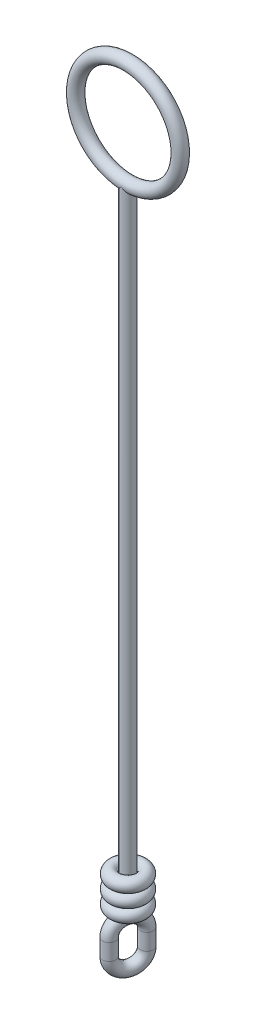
ISO-10303-21;
HEADER;
FILE_DESCRIPTION(('STEP AP214'),'2;1');
FILE_NAME('part.step','',(''),(''),'','','');
FILE_SCHEMA(('AUTOMOTIVE_DESIGN { 1 0 10303 214 1 1 1 1 }'));
ENDSEC;
DATA;
#1=APPLICATION_CONTEXT('core data for automotive mechanical design processes');
#2=APPLICATION_PROTOCOL_DEFINITION('international standard','automotive_design',2000,#1);
#3=PRODUCT_CONTEXT('',#1,'mechanical');
#4=PRODUCT('Part','Part','',(#3));
#5=PRODUCT_RELATED_PRODUCT_CATEGORY('part','',(#4));
#6=PRODUCT_DEFINITION_FORMATION('','',#4);
#7=PRODUCT_DEFINITION_CONTEXT('part definition',#1,'design');
#8=PRODUCT_DEFINITION('design','',#6,#7);
#9=PRODUCT_DEFINITION_SHAPE('','',#8);
#10=(LENGTH_UNIT() NAMED_UNIT(*) SI_UNIT(.MILLI.,.METRE.));
#11=(NAMED_UNIT(*) PLANE_ANGLE_UNIT() SI_UNIT($,.RADIAN.));
#12=(NAMED_UNIT(*) SI_UNIT($,.STERADIAN.) SOLID_ANGLE_UNIT());
#13=UNCERTAINTY_MEASURE_WITH_UNIT(LENGTH_MEASURE(1.E-05),#10,'distance_accuracy_value','');
#14=(GEOMETRIC_REPRESENTATION_CONTEXT(3) GLOBAL_UNCERTAINTY_ASSIGNED_CONTEXT((#13)) GLOBAL_UNIT_ASSIGNED_CONTEXT((#10,
#11,#12)) REPRESENTATION_CONTEXT('',''));
#15=CARTESIAN_POINT('',(0.,0.,0.));
#16=DIRECTION('',(0.,0.,1.));
#17=DIRECTION('',(1.,0.,0.));
#18=AXIS2_PLACEMENT_3D('',#15,#16,#17);
#19=CARTESIAN_POINT('',(0.,-39.8,0.));
#20=DIRECTION('',(0.,-1.,0.));
#21=DIRECTION('',(0.,0.,-1.));
#22=AXIS2_PLACEMENT_3D('',#19,#20,#21);
#23=TOROIDAL_SURFACE('',#22,0.8,0.399999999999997);
#24=CARTESIAN_POINT('',(0.,-39.8,-1.2));
#25=VERTEX_POINT('',#24);
#26=VERTEX_LOOP('',#25);
#27=FACE_BOUND('',#26,.T.);
#28=ADVANCED_FACE('F34',(#27),#23,.T.);
#29=CLOSED_SHELL('',(#28));
#30=MANIFOLD_SOLID_BREP('B2',#29);
#31=CARTESIAN_POINT('',(0.,-41.4,0.));
#32=DIRECTION('',(0.,-1.,0.));
#33=DIRECTION('',(0.,0.,-1.));
#34=AXIS2_PLACEMENT_3D('',#31,#32,#33);
#35=TOROIDAL_SURFACE('',#34,0.8,0.399999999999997);
#36=CARTESIAN_POINT('',(0.,-41.4,-1.2));
#37=VERTEX_POINT('',#36);
#38=VERTEX_LOOP('',#37);
#39=FACE_BOUND('',#38,.T.);
#40=ADVANCED_FACE('F53',(#39),#35,.T.);
#41=CLOSED_SHELL('',(#40));
#42=MANIFOLD_SOLID_BREP('B6',#41);
#43=CARTESIAN_POINT('',(0.,-40.6,0.));
#44=DIRECTION('',(0.,-1.,0.));
#45=DIRECTION('',(0.,0.,-1.));
#46=AXIS2_PLACEMENT_3D('',#43,#44,#45);
#47=TOROIDAL_SURFACE('',#46,0.8,0.399999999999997);
#48=CARTESIAN_POINT('',(0.,-40.6,-1.2));
#49=VERTEX_POINT('',#48);
#50=VERTEX_LOOP('',#49);
#51=FACE_BOUND('',#50,.T.);
#52=ADVANCED_FACE('F75',(#51),#47,.T.);
#53=CLOSED_SHELL('',(#52));
#54=MANIFOLD_SOLID_BREP('B30',#53);
#55=CARTESIAN_POINT('',(0.,-3.2,0.));
#56=DIRECTION('',(0.,-1.,0.));
#57=DIRECTION('',(1.,0.,0.));
#58=AXIS2_PLACEMENT_3D('',#55,#56,#57);
#59=CYLINDRICAL_SURFACE('',#58,0.4);
#60=CARTESIAN_POINT('',(0.375877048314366,-42.,0.136808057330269));
#61=CARTESIAN_POINT('',(0.375554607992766,-41.9990572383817,0.137693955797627));
#62=CARTESIAN_POINT('',(0.37522876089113,-41.9981151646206,0.138579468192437));
#63=CARTESIAN_POINT('',(0.36656577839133,-41.9733473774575,0.161866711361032));
#64=CARTESIAN_POINT('',(0.35604426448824,-41.9499698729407,0.184005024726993));
#65=CARTESIAN_POINT('',(0.330333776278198,-41.9044959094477,0.226951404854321));
#66=CARTESIAN_POINT('',(0.31513764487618,-41.8824014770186,0.24775737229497));
#67=CARTESIAN_POINT('',(0.282653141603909,-41.8433468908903,0.283903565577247));
#68=CARTESIAN_POINT('',(0.266068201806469,-41.8261253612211,0.299589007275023));
#69=CARTESIAN_POINT('',(0.229440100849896,-41.793373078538,0.328480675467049));
#70=CARTESIAN_POINT('',(0.209402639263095,-41.7778396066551,0.341690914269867));
#71=CARTESIAN_POINT('',(0.170107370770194,-41.7516561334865,0.362576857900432));
#72=CARTESIAN_POINT('',(0.151402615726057,-41.7406358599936,0.370825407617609));
#73=CARTESIAN_POINT('',(0.112081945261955,-41.7203692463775,0.384539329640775));
#74=CARTESIAN_POINT('',(0.0914662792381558,-41.7111226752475,0.390005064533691));
#75=CARTESIAN_POINT('',(0.0486112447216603,-41.6947111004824,0.397635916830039));
#76=CARTESIAN_POINT('',(0.0263595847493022,-41.6875644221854,0.399772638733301));
#77=CARTESIAN_POINT('',(-0.0188517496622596,-41.6758495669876,0.40019213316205));
#78=CARTESIAN_POINT('',(-0.0418106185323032,-41.6712785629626,0.39847914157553));
#79=CARTESIAN_POINT('',(-0.0841025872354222,-41.6654630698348,0.39155699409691));
#80=CARTESIAN_POINT('',(-0.103473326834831,-41.6638288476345,0.38689780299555));
#81=CARTESIAN_POINT('',(-0.141354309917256,-41.6627289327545,0.374718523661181));
#82=CARTESIAN_POINT('',(-0.159865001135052,-41.66326209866,0.36719994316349));
#83=CARTESIAN_POINT('',(-0.193959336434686,-41.6663348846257,0.350303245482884));
#84=CARTESIAN_POINT('',(-0.209658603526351,-41.668707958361,0.341125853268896));
#85=CARTESIAN_POINT('',(-0.239433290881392,-41.6751537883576,0.320928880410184));
#86=CARTESIAN_POINT('',(-0.253508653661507,-41.6792266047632,0.309909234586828));
#87=CARTESIAN_POINT('',(-0.280236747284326,-41.6890852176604,0.286007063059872));
#88=CARTESIAN_POINT('',(-0.292822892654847,-41.6949257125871,0.273073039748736));
#89=CARTESIAN_POINT('',(-0.315843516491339,-41.7080571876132,0.2460851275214));
#90=CARTESIAN_POINT('',(-0.326277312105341,-41.7153486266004,0.232030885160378));
#91=CARTESIAN_POINT('',(-0.346136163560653,-41.7321665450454,0.201402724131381));
#92=CARTESIAN_POINT('',(-0.355272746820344,-41.7418584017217,0.184733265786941));
#93=CARTESIAN_POINT('',(-0.370884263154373,-41.7625497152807,0.150968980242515));
#94=CARTESIAN_POINT('',(-0.377357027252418,-41.7735502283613,0.133873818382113));
#95=CARTESIAN_POINT('',(-0.390247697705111,-41.8020350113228,0.0916319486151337));
#96=CARTESIAN_POINT('',(-0.395221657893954,-41.8201439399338,0.0664621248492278));
#97=CARTESIAN_POINT('',(-0.400416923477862,-41.8580982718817,0.0169600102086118));
#98=CARTESIAN_POINT('',(-0.400631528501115,-41.8779460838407,-0.00737105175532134));
#99=CARTESIAN_POINT('',(-0.397386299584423,-41.9142364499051,-0.0491686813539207));
#100=CARTESIAN_POINT('',(-0.394754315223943,-41.9304216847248,-0.0669340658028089));
#101=CARTESIAN_POINT('',(-0.387338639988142,-41.9633854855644,-0.101382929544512));
#102=CARTESIAN_POINT('',(-0.38255860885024,-41.9801629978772,-0.118068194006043));
#103=CARTESIAN_POINT('',(-0.376519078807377,-41.9981151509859,-0.135034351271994));
#104=CARTESIAN_POINT('',(-0.376199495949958,-41.9990572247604,-0.135922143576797));
#105=CARTESIAN_POINT('',(-0.37587704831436,-42.,-0.13680805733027));
#106=B_SPLINE_CURVE_WITH_KNOTS('',3,(#60,#61,#62,#63,#64,#65,#66,#67,#68,#69,#70,#71,#72,#73,
#74,#75,#76,#77,#78,#79,#80,#81,#82,#83,#84,#85,#86,#87,#88,#89,#90,#91,#92,#93,#94,#95,#96,#97,
#98,#99,#100,#101,#102,#103,#104,#105),.UNSPECIFIED.,.F.,.F.,(4,2,2,2,2,2,2,2,2,2,2,2,2,2,2,2,2,
2,2,2,2,2,4),(0.,0.00400001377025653,0.105241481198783,0.206638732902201,0.29211099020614,
0.377443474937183,0.446842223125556,0.516231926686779,0.586210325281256,0.656111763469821,
0.71575494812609,0.77536672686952,0.830134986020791,0.884905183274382,0.941582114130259,
0.998276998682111,1.06204858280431,1.12587198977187,1.2195708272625,1.31340156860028,
1.3858065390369,1.45808861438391,1.46208862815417),.UNSPECIFIED.);
#107=CARTESIAN_POINT('',(0.375877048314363,-42.,0.136808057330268));
#108=VERTEX_POINT('',#107);
#109=CARTESIAN_POINT('',(-0.375877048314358,-42.,-0.136808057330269));
#110=VERTEX_POINT('',#109);
#111=EDGE_CURVE('E120',#108,#110,#106,.T.);
#112=ORIENTED_EDGE('',*,*,#111,.F.);
#113=CARTESIAN_POINT('',(-0.37587704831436,-42.,-0.13680805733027));
#114=CARTESIAN_POINT('',(-0.375554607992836,-41.9990572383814,-0.137693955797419));
#115=CARTESIAN_POINT('',(-0.375228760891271,-41.9981151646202,-0.138579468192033));
#116=CARTESIAN_POINT('',(-0.366565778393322,-41.9733473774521,-0.161866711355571));
#117=CARTESIAN_POINT('',(-0.356044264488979,-41.9499698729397,-0.184005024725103));
#118=CARTESIAN_POINT('',(-0.330333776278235,-41.90449590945,-0.226951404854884));
#119=CARTESIAN_POINT('',(-0.315137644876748,-41.8824014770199,-0.247757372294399));
#120=CARTESIAN_POINT('',(-0.282653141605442,-41.8433468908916,-0.283903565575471));
#121=CARTESIAN_POINT('',(-0.266068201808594,-41.8261253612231,-0.299589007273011));
#122=CARTESIAN_POINT('',(-0.229440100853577,-41.7933730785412,-0.328480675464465));
#123=CARTESIAN_POINT('',(-0.209402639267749,-41.7778396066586,-0.341690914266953));
#124=CARTESIAN_POINT('',(-0.170107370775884,-41.75165613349,-0.362576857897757));
#125=CARTESIAN_POINT('',(-0.151402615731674,-41.7406358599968,-0.370825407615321));
#126=CARTESIAN_POINT('',(-0.112081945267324,-41.72036924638,-0.384539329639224));
#127=CARTESIAN_POINT('',(-0.091466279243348,-41.7111226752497,-0.390005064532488));
#128=CARTESIAN_POINT('',(-0.0486112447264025,-41.694711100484,-0.397635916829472));
#129=CARTESIAN_POINT('',(-0.0263595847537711,-41.6875644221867,-0.399772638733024));
#130=CARTESIAN_POINT('',(0.018851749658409,-41.6758495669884,-0.40019213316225));
#131=CARTESIAN_POINT('',(0.0418106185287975,-41.6712785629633,-0.398479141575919));
#132=CARTESIAN_POINT('',(0.0841025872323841,-41.6654630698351,-0.391556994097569));
#133=CARTESIAN_POINT('',(0.103473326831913,-41.6638288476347,-0.386897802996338));
#134=CARTESIAN_POINT('',(0.141354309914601,-41.6627289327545,-0.374718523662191));
#135=CARTESIAN_POINT('',(0.159865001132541,-41.6632620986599,-0.367199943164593));
#136=CARTESIAN_POINT('',(0.193959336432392,-41.6663348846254,-0.35030324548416));
#137=CARTESIAN_POINT('',(0.209658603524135,-41.6687079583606,-0.341125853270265));
#138=CARTESIAN_POINT('',(0.239433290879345,-41.6751537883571,-0.320928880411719));
#139=CARTESIAN_POINT('',(0.253508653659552,-41.6792266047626,-0.309909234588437));
#140=CARTESIAN_POINT('',(0.280236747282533,-41.6890852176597,-0.286007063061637));
#141=CARTESIAN_POINT('',(0.29282289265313,-41.6949257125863,-0.273073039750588));
#142=CARTESIAN_POINT('',(0.315843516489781,-41.7080571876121,-0.246085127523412));
#143=CARTESIAN_POINT('',(0.326277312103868,-41.7153486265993,-0.232030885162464));
#144=CARTESIAN_POINT('',(0.346136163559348,-41.7321665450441,-0.201402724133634));
#145=CARTESIAN_POINT('',(0.355272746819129,-41.7418584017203,-0.184733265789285));
#146=CARTESIAN_POINT('',(0.370884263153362,-41.7625497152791,-0.150968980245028));
#147=CARTESIAN_POINT('',(0.377357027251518,-41.7735502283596,-0.133873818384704));
#148=CARTESIAN_POINT('',(0.390247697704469,-41.8020350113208,-0.0916319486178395));
#149=CARTESIAN_POINT('',(0.395221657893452,-41.8201439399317,-0.0664621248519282));
#150=CARTESIAN_POINT('',(0.400416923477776,-41.8580982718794,-0.016960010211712));
#151=CARTESIAN_POINT('',(0.400631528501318,-41.8779460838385,0.00737105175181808));
#152=CARTESIAN_POINT('',(0.397386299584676,-41.9142364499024,0.0491686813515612));
#153=CARTESIAN_POINT('',(0.394754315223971,-41.9304216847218,0.0669340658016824));
#154=CARTESIAN_POINT('',(0.387338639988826,-41.9633854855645,0.10138292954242));
#155=CARTESIAN_POINT('',(0.382558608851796,-41.9801629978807,0.118068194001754));
#156=CARTESIAN_POINT('',(0.376519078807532,-41.9981151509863,0.135034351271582));
#157=CARTESIAN_POINT('',(0.376199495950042,-41.9990572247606,0.135922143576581));
#158=CARTESIAN_POINT('',(0.375877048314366,-42.,0.136808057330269));
#159=B_SPLINE_CURVE_WITH_KNOTS('',3,(#113,#114,#115,#116,#117,#118,#119,#120,#121,#122,#123,
#124,#125,#126,#127,#128,#129,#130,#131,#132,#133,#134,#135,#136,#137,#138,#139,#140,#141,#142,
#143,#144,#145,#146,#147,#148,#149,#150,#151,#152,#153,#154,#155,#156,#157,#158),.UNSPECIFIED.,
.F.,.F.,(4,2,2,2,2,2,2,2,2,2,2,2,2,2,2,2,2,2,2,2,2,2,4),(0.,0.0040000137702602,
0.105241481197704,0.206638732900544,0.292110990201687,0.377443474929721,0.446842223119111,
0.516231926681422,0.586210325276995,0.656111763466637,0.715754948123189,0.775366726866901,
0.830134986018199,0.884905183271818,0.941582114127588,0.998276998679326,1.06204858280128,
1.12587198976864,1.21957082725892,1.31340156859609,1.38580653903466,1.45808861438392,
1.46208862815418),.UNSPECIFIED.);
#160=EDGE_CURVE('E123',#110,#108,#159,.T.);
#161=ORIENTED_EDGE('',*,*,#160,.F.);
#162=EDGE_LOOP('',(#112,#161));
#163=FACE_BOUND('',#162,.T.);
#164=CARTESIAN_POINT('',(0.,-3.2,0.400000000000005));
#165=CARTESIAN_POINT('',(0.000942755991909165,-3.20094275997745,0.399999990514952));
#166=CARTESIAN_POINT('',(0.00188577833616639,-3.20188536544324,0.399996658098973));
#167=CARTESIAN_POINT('',(0.0324562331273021,-3.23242870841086,0.399780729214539));
#168=CARTESIAN_POINT('',(0.0623311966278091,-3.26186337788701,0.396286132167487));
#169=CARTESIAN_POINT('',(0.121684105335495,-3.31957991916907,0.38226275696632));
#170=CARTESIAN_POINT('',(0.151161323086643,-3.34785983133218,0.371722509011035));
#171=CARTESIAN_POINT('',(0.199608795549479,-3.39379611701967,0.347344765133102));
#172=CARTESIAN_POINT('',(0.219024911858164,-3.41204716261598,0.335514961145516));
#173=CARTESIAN_POINT('',(0.256413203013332,-3.44693292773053,0.307881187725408));
#174=CARTESIAN_POINT('',(0.274388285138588,-3.46357091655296,0.292085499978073));
#175=CARTESIAN_POINT('',(0.304279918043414,-3.49106527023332,0.260339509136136));
#176=CARTESIAN_POINT('',(0.316651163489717,-3.50238147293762,0.245218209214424));
#177=CARTESIAN_POINT('',(0.339489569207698,-3.52318621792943,0.212470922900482));
#178=CARTESIAN_POINT('',(0.349958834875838,-3.53267678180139,0.194847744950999));
#179=CARTESIAN_POINT('',(0.36672383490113,-3.5478274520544,0.160651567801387));
#180=CARTESIAN_POINT('',(0.37343078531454,-3.5538687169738,0.144450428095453));
#181=CARTESIAN_POINT('',(0.384766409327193,-3.56406104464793,0.110769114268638));
#182=CARTESIAN_POINT('',(0.38939628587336,-3.56821320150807,0.0932896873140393));
#183=CARTESIAN_POINT('',(0.396284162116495,-3.57438504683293,0.0573962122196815));
#184=CARTESIAN_POINT('',(0.398529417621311,-3.576393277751,0.0389776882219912));
#185=CARTESIAN_POINT('',(0.400425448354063,-3.57808939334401,0.00190167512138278));
#186=CARTESIAN_POINT('',(0.400076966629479,-3.57777794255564,-0.016755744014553));
#187=CARTESIAN_POINT('',(0.396964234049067,-3.57499267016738,-0.0520043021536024));
#188=CARTESIAN_POINT('',(0.394418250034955,-3.57271421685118,-0.0686312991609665));
#189=CARTESIAN_POINT('',(0.387366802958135,-3.56639277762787,-0.101110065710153));
#190=CARTESIAN_POINT('',(0.382861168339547,-3.56234963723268,-0.116961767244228));
#191=CARTESIAN_POINT('',(0.371919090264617,-3.55250716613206,-0.148193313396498));
#192=CARTESIAN_POINT('',(0.365411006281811,-3.54664258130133,-0.163527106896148));
#193=CARTESIAN_POINT('',(0.350859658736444,-3.5334890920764,-0.192782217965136));
#194=CARTESIAN_POINT('',(0.342815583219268,-3.52619943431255,-0.20670278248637));
#195=CARTESIAN_POINT('',(0.321449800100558,-3.50676649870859,-0.239173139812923));
#196=CARTESIAN_POINT('',(0.307416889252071,-3.49394561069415,-0.256852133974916));
#197=CARTESIAN_POINT('',(0.27751076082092,-3.46644761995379,-0.288913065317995));
#198=CARTESIAN_POINT('',(0.261633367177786,-3.45176629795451,-0.303287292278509));
#199=CARTESIAN_POINT('',(0.223023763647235,-3.41581245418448,-0.333233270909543));
#200=CARTESIAN_POINT('',(0.199805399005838,-3.39400388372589,-0.347530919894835));
#201=CARTESIAN_POINT('',(0.15226022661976,-3.34887680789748,-0.370835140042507));
#202=CARTESIAN_POINT('',(0.127932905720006,-3.32555760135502,-0.379839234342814));
#203=CARTESIAN_POINT('',(0.0867126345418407,-3.28560864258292,-0.390870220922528));
#204=CARTESIAN_POINT('',(0.0699215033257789,-3.26921572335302,-0.394206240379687));
#205=CARTESIAN_POINT('',(0.0363392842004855,-3.23617727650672,-0.398705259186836));
#206=CARTESIAN_POINT('',(0.0195482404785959,-3.2195322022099,-0.399871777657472));
#207=CARTESIAN_POINT('',(0.00188580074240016,-3.20188538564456,-0.399996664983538));
#208=CARTESIAN_POINT('',(0.000942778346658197,-3.20094278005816,-0.399999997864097));
#209=CARTESIAN_POINT('',(0.,-3.2,-0.400000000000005));
#210=B_SPLINE_CURVE_WITH_KNOTS('',3,(#164,#165,#166,#167,#168,#169,#170,#171,#172,#173,#174,
#175,#176,#177,#178,#179,#180,#181,#182,#183,#184,#185,#186,#187,#188,#189,#190,#191,#192,#193,
#194,#195,#196,#197,#198,#199,#200,#201,#202,#203,#204,#205,#206,#207,#208,#209),.UNSPECIFIED.,
.F.,.F.,(4,2,2,2,2,2,2,2,2,2,2,2,2,2,2,2,2,2,2,2,2,2,4),(0.,0.00400001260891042,
0.129635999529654,0.255477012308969,0.342658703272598,0.429659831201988,0.497151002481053,
0.564567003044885,0.61997755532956,0.675355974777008,0.731028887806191,0.786685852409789,
0.837378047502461,0.888074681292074,0.94085154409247,0.993656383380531,1.07110042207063,
1.14872334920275,1.25291478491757,1.35715493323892,1.42817071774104,1.49907120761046,
1.50307122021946),.UNSPECIFIED.);
#211=CARTESIAN_POINT('',(0.,-3.2,0.4));
#212=VERTEX_POINT('',#211);
#213=CARTESIAN_POINT('',(7.11994768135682E-13,-3.2,-0.4));
#214=VERTEX_POINT('',#213);
#215=EDGE_CURVE('E73',#212,#214,#210,.T.);
#216=ORIENTED_EDGE('',*,*,#215,.F.);
#217=CARTESIAN_POINT('',(0.,-3.2,-0.400000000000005));
#218=CARTESIAN_POINT('',(-0.000942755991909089,-3.20094275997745,-0.399999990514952));
#219=CARTESIAN_POINT('',(-0.00188577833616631,-3.20188536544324,-0.399996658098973));
#220=CARTESIAN_POINT('',(-0.032456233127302,-3.23242870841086,-0.399780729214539));
#221=CARTESIAN_POINT('',(-0.0623311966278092,-3.26186337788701,-0.396286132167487));
#222=CARTESIAN_POINT('',(-0.121684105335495,-3.31957991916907,-0.38226275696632));
#223=CARTESIAN_POINT('',(-0.151161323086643,-3.34785983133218,-0.371722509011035));
#224=CARTESIAN_POINT('',(-0.199608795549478,-3.39379611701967,-0.347344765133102));
#225=CARTESIAN_POINT('',(-0.219024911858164,-3.41204716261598,-0.335514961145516));
#226=CARTESIAN_POINT('',(-0.256413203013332,-3.44693292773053,-0.307881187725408));
#227=CARTESIAN_POINT('',(-0.274388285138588,-3.46357091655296,-0.292085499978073));
#228=CARTESIAN_POINT('',(-0.304279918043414,-3.49106527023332,-0.260339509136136));
#229=CARTESIAN_POINT('',(-0.316651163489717,-3.50238147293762,-0.245218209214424));
#230=CARTESIAN_POINT('',(-0.339489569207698,-3.52318621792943,-0.212470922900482));
#231=CARTESIAN_POINT('',(-0.349958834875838,-3.53267678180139,-0.194847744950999));
#232=CARTESIAN_POINT('',(-0.366723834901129,-3.5478274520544,-0.160651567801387));
#233=CARTESIAN_POINT('',(-0.373430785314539,-3.5538687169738,-0.144450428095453));
#234=CARTESIAN_POINT('',(-0.384766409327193,-3.56406104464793,-0.110769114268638));
#235=CARTESIAN_POINT('',(-0.38939628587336,-3.56821320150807,-0.093289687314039));
#236=CARTESIAN_POINT('',(-0.396284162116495,-3.57438504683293,-0.0573962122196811));
#237=CARTESIAN_POINT('',(-0.398529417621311,-3.576393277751,-0.0389776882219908));
#238=CARTESIAN_POINT('',(-0.400425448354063,-3.57808939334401,-0.00190167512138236));
#239=CARTESIAN_POINT('',(-0.400076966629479,-3.57777794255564,0.0167557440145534));
#240=CARTESIAN_POINT('',(-0.396964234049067,-3.57499267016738,0.0520043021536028));
#241=CARTESIAN_POINT('',(-0.394418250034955,-3.57271421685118,0.0686312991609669));
#242=CARTESIAN_POINT('',(-0.387366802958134,-3.56639277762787,0.101110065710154));
#243=CARTESIAN_POINT('',(-0.382861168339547,-3.56234963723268,0.116961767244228));
#244=CARTESIAN_POINT('',(-0.371919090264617,-3.55250716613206,0.148193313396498));
#245=CARTESIAN_POINT('',(-0.36541100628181,-3.54664258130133,0.163527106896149));
#246=CARTESIAN_POINT('',(-0.350859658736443,-3.5334890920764,0.192782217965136));
#247=CARTESIAN_POINT('',(-0.342815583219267,-3.52619943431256,0.20670278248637));
#248=CARTESIAN_POINT('',(-0.321449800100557,-3.50676649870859,0.239173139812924));
#249=CARTESIAN_POINT('',(-0.30741688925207,-3.49394561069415,0.256852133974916));
#250=CARTESIAN_POINT('',(-0.27751076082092,-3.46644761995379,0.288913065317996));
#251=CARTESIAN_POINT('',(-0.261633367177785,-3.45176629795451,0.303287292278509));
#252=CARTESIAN_POINT('',(-0.223023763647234,-3.41581245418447,0.333233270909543));
#253=CARTESIAN_POINT('',(-0.199805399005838,-3.39400388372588,0.347530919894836));
#254=CARTESIAN_POINT('',(-0.152260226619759,-3.34887680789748,0.370835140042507));
#255=CARTESIAN_POINT('',(-0.127932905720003,-3.32555760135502,0.379839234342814));
#256=CARTESIAN_POINT('',(-0.086712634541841,-3.28560864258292,0.390870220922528));
#257=CARTESIAN_POINT('',(-0.0699215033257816,-3.26921572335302,0.394206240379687));
#258=CARTESIAN_POINT('',(-0.0363392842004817,-3.23617727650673,0.398705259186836));
#259=CARTESIAN_POINT('',(-0.019548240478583,-3.21953220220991,0.399871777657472));
#260=CARTESIAN_POINT('',(-0.00188580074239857,-3.20188538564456,0.399996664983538));
#261=CARTESIAN_POINT('',(-0.000942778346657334,-3.20094278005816,0.399999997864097));
#262=CARTESIAN_POINT('',(0.,-3.2,0.400000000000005));
#263=B_SPLINE_CURVE_WITH_KNOTS('',3,(#217,#218,#219,#220,#221,#222,#223,#224,#225,#226,#227,
#228,#229,#230,#231,#232,#233,#234,#235,#236,#237,#238,#239,#240,#241,#242,#243,#244,#245,#246,
#247,#248,#249,#250,#251,#252,#253,#254,#255,#256,#257,#258,#259,#260,#261,#262),.UNSPECIFIED.,
.F.,.F.,(4,2,2,2,2,2,2,2,2,2,2,2,2,2,2,2,2,2,2,2,2,2,4),(0.,0.00400001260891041,
0.129635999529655,0.255477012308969,0.342658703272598,0.429659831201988,0.497151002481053,
0.564567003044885,0.61997755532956,0.675355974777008,0.731028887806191,0.786685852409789,
0.837378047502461,0.888074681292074,0.940851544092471,0.993656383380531,1.07110042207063,
1.14872334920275,1.25291478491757,1.35715493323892,1.42817071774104,1.49907120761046,
1.50307122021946),.UNSPECIFIED.);
#264=EDGE_CURVE('E100',#214,#212,#263,.T.);
#265=ORIENTED_EDGE('',*,*,#264,.F.);
#266=EDGE_LOOP('',(#216,#265));
#267=FACE_BOUND('',#266,.T.);
#268=ADVANCED_FACE('F88',(#163,#267),#59,.T.);
#269=CARTESIAN_POINT('',(0.,0.,0.));
#270=DIRECTION('',(0.,0.,-1.));
#271=DIRECTION('',(-1.,0.,0.));
#272=AXIS2_PLACEMENT_3D('',#269,#270,#271);
#273=TOROIDAL_SURFACE('',#272,3.2,0.4);
#274=ORIENTED_EDGE('',*,*,#264,.T.);
#275=ORIENTED_EDGE('',*,*,#215,.T.);
#276=EDGE_LOOP('',(#274,#275));
#277=FACE_BOUND('',#276,.T.);
#278=ADVANCED_FACE('F90',(#277),#273,.T.);
#279=CARTESIAN_POINT('',(0.,-42.9,0.));
#280=DIRECTION('',(-0.939692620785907,0.,-0.342020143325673));
#281=DIRECTION('',(-0.342020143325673,0.,0.939692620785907));
#282=AXIS2_PLACEMENT_3D('',#279,#280,#281);
#283=TOROIDAL_SURFACE('',#282,0.899999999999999,0.4);
#284=CARTESIAN_POINT('',(-0.209235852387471,-41.7529411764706,0.574870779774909));
#285=VERTEX_POINT('',#284);
#286=VERTEX_LOOP('',#285);
#287=FACE_BOUND('',#286,.T.);
#288=CARTESIAN_POINT('',(0.209235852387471,-41.7529411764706,-0.57487077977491));
#289=VERTEX_POINT('',#288);
#290=VERTEX_LOOP('',#289);
#291=FACE_BOUND('',#290,.T.);
#292=CARTESIAN_POINT('',(0.307818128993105,-42.9,-0.445723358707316));
#293=CARTESIAN_POINT('',(0.314363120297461,-42.9,-0.445723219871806));
#294=CARTESIAN_POINT('',(0.320908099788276,-42.9,-0.445883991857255));
#295=CARTESIAN_POINT('',(0.333982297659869,-42.9,-0.446526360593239));
#296=CARTESIAN_POINT('',(0.340511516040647,-42.9,-0.447007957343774));
#297=CARTESIAN_POINT('',(0.353538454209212,-42.9,-0.4482909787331));
#298=CARTESIAN_POINT('',(0.360036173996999,-42.9,-0.44909240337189));
#299=CARTESIAN_POINT('',(0.372984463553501,-42.9,-0.451013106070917));
#300=CARTESIAN_POINT('',(0.379435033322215,-42.9,-0.452132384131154));
#301=CARTESIAN_POINT('',(0.392273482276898,-42.9,-0.454686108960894));
#302=CARTESIAN_POINT('',(0.398661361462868,-42.9,-0.456120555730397));
#303=CARTESIAN_POINT('',(0.411359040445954,-42.9,-0.459301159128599));
#304=CARTESIAN_POINT('',(0.417668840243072,-42.9,-0.461047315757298));
#305=CARTESIAN_POINT('',(0.430195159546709,-42.9,-0.464847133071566));
#306=CARTESIAN_POINT('',(0.436411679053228,-42.9,-0.466900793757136));
#307=CARTESIAN_POINT('',(0.448736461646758,-42.9,-0.471310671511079));
#308=CARTESIAN_POINT('',(0.454844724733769,-42.9,-0.473666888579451));
#309=CARTESIAN_POINT('',(0.466938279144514,-42.9,-0.478676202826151));
#310=CARTESIAN_POINT('',(0.472923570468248,-42.9,-0.481329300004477));
#311=CARTESIAN_POINT('',(0.484756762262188,-42.9,-0.4869259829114));
#312=CARTESIAN_POINT('',(0.490604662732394,-42.9,-0.489869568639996));
#313=CARTESIAN_POINT('',(0.502148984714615,-42.9,-0.496040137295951));
#314=CARTESIAN_POINT('',(0.50784540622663,-42.9,-0.49926712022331));
#315=CARTESIAN_POINT('',(0.519073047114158,-42.9,-0.505996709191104));
#316=CARTESIAN_POINT('',(0.52460426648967,-42.9,-0.50949931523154));
#317=CARTESIAN_POINT('',(0.535488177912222,-42.9,-0.516771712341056));
#318=CARTESIAN_POINT('',(0.540840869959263,-42.9,-0.520541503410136));
#319=CARTESIAN_POINT('',(0.551354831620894,-42.9,-0.528339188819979));
#320=CARTESIAN_POINT('',(0.556516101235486,-42.9,-0.532367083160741));
#321=CARTESIAN_POINT('',(0.566634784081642,-42.9,-0.540671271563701));
#322=CARTESIAN_POINT('',(0.571592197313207,-42.9,-0.544947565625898));
#323=CARTESIAN_POINT('',(0.581291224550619,-42.9,-0.553738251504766));
#324=CARTESIAN_POINT('',(0.586032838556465,-42.9,-0.558252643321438));
#325=CARTESIAN_POINT('',(0.595288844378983,-42.9,-0.567508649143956));
#326=CARTESIAN_POINT('',(0.599803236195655,-42.9,-0.572250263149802));
#327=CARTESIAN_POINT('',(0.608593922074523,-42.9,-0.581949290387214));
#328=CARTESIAN_POINT('',(0.612870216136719,-42.9,-0.58690670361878));
#329=CARTESIAN_POINT('',(0.621174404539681,-42.9,-0.597025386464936));
#330=CARTESIAN_POINT('',(0.625202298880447,-42.9,-0.602186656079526));
#331=CARTESIAN_POINT('',(0.63299998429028,-42.9,-0.612700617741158));
#332=CARTESIAN_POINT('',(0.636769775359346,-42.9,-0.6180533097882));
#333=CARTESIAN_POINT('',(0.644042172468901,-42.9,-0.62893722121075));
#334=CARTESIAN_POINT('',(0.647544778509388,-42.9,-0.63446844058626));
#335=CARTESIAN_POINT('',(0.65427436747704,-42.9,-0.645696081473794));
#336=CARTESIAN_POINT('',(0.657501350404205,-42.9,-0.651392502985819));
#337=CARTESIAN_POINT('',(0.66367191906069,-42.9,-0.662936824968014));
#338=CARTESIAN_POINT('',(0.66661550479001,-42.9,-0.668784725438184));
#339=CARTESIAN_POINT('',(0.672212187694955,-42.9,-0.680617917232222));
#340=CARTESIAN_POINT('',(0.674865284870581,-42.9,-0.686603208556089));
#341=CARTESIAN_POINT('',(0.679874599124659,-42.9,-0.698696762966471));
#342=CARTESIAN_POINT('',(0.68223081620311,-42.9,-0.704805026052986));
#343=CARTESIAN_POINT('',(0.686640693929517,-42.9,-0.717129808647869));
#344=CARTESIAN_POINT('',(0.688694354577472,-42.9,-0.723346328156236));
#345=CARTESIAN_POINT('',(0.692494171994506,-42.9,-0.735872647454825));
#346=CARTESIAN_POINT('',(0.694240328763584,-42.9,-0.742182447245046));
#347=CARTESIAN_POINT('',(0.697420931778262,-42.9,-0.754880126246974));
#348=CARTESIAN_POINT('',(0.698855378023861,-42.9,-0.761268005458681));
#349=CARTESIAN_POINT('',(0.701409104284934,-42.9,-0.774106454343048));
#350=CARTESIAN_POINT('',(0.702528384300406,-42.9,-0.780557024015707));
#351=CARTESIAN_POINT('',(0.704449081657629,-42.9,-0.793505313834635));
#352=CARTESIAN_POINT('',(0.70525049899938,-42.9,-0.800003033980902));
#353=CARTESIAN_POINT('',(0.706533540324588,-42.9,-0.813029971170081));
#354=CARTESIAN_POINT('',(0.707015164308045,-42.9,-0.819559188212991));
#355=CARTESIAN_POINT('',(0.707657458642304,-42.9,-0.832633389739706));
#356=CARTESIAN_POINT('',(0.707818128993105,-42.9,-0.839178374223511));
#357=CARTESIAN_POINT('',(0.707818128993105,-42.9,-0.852268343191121));
#358=CARTESIAN_POINT('',(0.707657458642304,-42.9,-0.858813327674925));
#359=CARTESIAN_POINT('',(0.707015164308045,-42.9,-0.87188752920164));
#360=CARTESIAN_POINT('',(0.706533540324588,-42.9,-0.878416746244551));
#361=CARTESIAN_POINT('',(0.70525049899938,-42.9,-0.891443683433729));
#362=CARTESIAN_POINT('',(0.704449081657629,-42.9,-0.897941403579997));
#363=CARTESIAN_POINT('',(0.702528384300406,-42.9,-0.910889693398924));
#364=CARTESIAN_POINT('',(0.701409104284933,-42.9,-0.917340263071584));
#365=CARTESIAN_POINT('',(0.698855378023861,-42.9,-0.93017871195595));
#366=CARTESIAN_POINT('',(0.697420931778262,-42.9,-0.936566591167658));
#367=CARTESIAN_POINT('',(0.694240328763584,-42.9,-0.949264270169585));
#368=CARTESIAN_POINT('',(0.692494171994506,-42.9,-0.955574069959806));
#369=CARTESIAN_POINT('',(0.688694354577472,-42.9,-0.968100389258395));
#370=CARTESIAN_POINT('',(0.686640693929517,-42.9,-0.974316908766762));
#371=CARTESIAN_POINT('',(0.68223081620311,-42.9,-0.986641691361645));
#372=CARTESIAN_POINT('',(0.679874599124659,-42.9,-0.99274995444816));
#373=CARTESIAN_POINT('',(0.674865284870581,-42.9,-1.00484350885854));
#374=CARTESIAN_POINT('',(0.672212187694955,-42.9,-1.01082880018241));
#375=CARTESIAN_POINT('',(0.66661550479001,-42.9,-1.02266199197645));
#376=CARTESIAN_POINT('',(0.66367191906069,-42.9,-1.02850989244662));
#377=CARTESIAN_POINT('',(0.657501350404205,-42.9,-1.04005421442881));
#378=CARTESIAN_POINT('',(0.65427436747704,-42.9,-1.04575063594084));
#379=CARTESIAN_POINT('',(0.647544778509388,-42.9,-1.05697827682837));
#380=CARTESIAN_POINT('',(0.644042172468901,-42.9,-1.06250949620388));
#381=CARTESIAN_POINT('',(0.636769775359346,-42.9,-1.07339340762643));
#382=CARTESIAN_POINT('',(0.63299998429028,-42.9,-1.07874609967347));
#383=CARTESIAN_POINT('',(0.625202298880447,-42.9,-1.08926006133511));
#384=CARTESIAN_POINT('',(0.621174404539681,-42.9,-1.0944213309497));
#385=CARTESIAN_POINT('',(0.612870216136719,-42.9,-1.10454001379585));
#386=CARTESIAN_POINT('',(0.608593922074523,-42.9,-1.10949742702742));
#387=CARTESIAN_POINT('',(0.599803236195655,-42.9,-1.11919645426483));
#388=CARTESIAN_POINT('',(0.595288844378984,-42.9,-1.12393806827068));
#389=CARTESIAN_POINT('',(0.586032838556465,-42.9,-1.13319407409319));
#390=CARTESIAN_POINT('',(0.581291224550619,-42.9,-1.13770846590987));
#391=CARTESIAN_POINT('',(0.571592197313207,-42.9,-1.14649915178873));
#392=CARTESIAN_POINT('',(0.566634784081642,-42.9,-1.15077544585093));
#393=CARTESIAN_POINT('',(0.556516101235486,-42.9,-1.15907963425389));
#394=CARTESIAN_POINT('',(0.551354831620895,-42.9,-1.16310752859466));
#395=CARTESIAN_POINT('',(0.540840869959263,-42.9,-1.17090521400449));
#396=CARTESIAN_POINT('',(0.535488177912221,-42.9,-1.17467500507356));
#397=CARTESIAN_POINT('',(0.524604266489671,-42.9,-1.18194740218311));
#398=CARTESIAN_POINT('',(0.519073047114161,-42.9,-1.1854500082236));
#399=CARTESIAN_POINT('',(0.507845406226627,-42.9,-1.19217959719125));
#400=CARTESIAN_POINT('',(0.502148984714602,-42.9,-1.19540658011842));
#401=CARTESIAN_POINT('',(0.490604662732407,-42.9,-1.2015771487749));
#402=CARTESIAN_POINT('',(0.484756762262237,-42.9,-1.20452073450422));
#403=CARTESIAN_POINT('',(0.472923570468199,-42.9,-1.21011741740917));
#404=CARTESIAN_POINT('',(0.466938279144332,-42.9,-1.21277051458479));
#405=CARTESIAN_POINT('',(0.45484472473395,-42.9,-1.21777982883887));
#406=CARTESIAN_POINT('',(0.448736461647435,-42.9,-1.22013604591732));
#407=CARTESIAN_POINT('',(0.436411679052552,-42.9,-1.22454592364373));
#408=CARTESIAN_POINT('',(0.430195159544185,-42.9,-1.22659958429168));
#409=CARTESIAN_POINT('',(0.417668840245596,-42.9,-1.23039940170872));
#410=CARTESIAN_POINT('',(0.411359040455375,-42.9,-1.23214555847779));
#411=CARTESIAN_POINT('',(0.398661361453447,-42.9,-1.23532616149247));
#412=CARTESIAN_POINT('',(0.39227348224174,-42.9,-1.23676060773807));
#413=CARTESIAN_POINT('',(0.379435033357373,-42.9,-1.23931433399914));
#414=CARTESIAN_POINT('',(0.372984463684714,-42.9,-1.24043361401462));
#415=CARTESIAN_POINT('',(0.360036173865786,-42.9,-1.24235431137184));
#416=CARTESIAN_POINT('',(0.353538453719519,-42.9,-1.24315572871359));
#417=CARTESIAN_POINT('',(0.340511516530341,-42.9,-1.2444387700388));
#418=CARTESIAN_POINT('',(0.33398229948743,-42.9,-1.24492039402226));
#419=CARTESIAN_POINT('',(0.320908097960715,-42.9,-1.24556268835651));
#420=CARTESIAN_POINT('',(0.31436311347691,-42.9,-1.24572335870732));
#421=CARTESIAN_POINT('',(0.301273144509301,-42.9,-1.24572335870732));
#422=CARTESIAN_POINT('',(0.294728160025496,-42.9,-1.24556268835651));
#423=CARTESIAN_POINT('',(0.28165395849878,-42.9,-1.24492039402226));
#424=CARTESIAN_POINT('',(0.27512474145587,-42.9,-1.2444387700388));
#425=CARTESIAN_POINT('',(0.262097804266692,-42.9,-1.24315572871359));
#426=CARTESIAN_POINT('',(0.255600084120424,-42.9,-1.24235431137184));
#427=CARTESIAN_POINT('',(0.242651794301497,-42.9,-1.24043361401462));
#428=CARTESIAN_POINT('',(0.236201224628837,-42.9,-1.23931433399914));
#429=CARTESIAN_POINT('',(0.223362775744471,-42.9,-1.23676060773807));
#430=CARTESIAN_POINT('',(0.216974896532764,-42.9,-1.23532616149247));
#431=CARTESIAN_POINT('',(0.204277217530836,-42.9,-1.23214555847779));
#432=CARTESIAN_POINT('',(0.197967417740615,-42.9,-1.23039940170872));
#433=CARTESIAN_POINT('',(0.185441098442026,-42.9,-1.22659958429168));
#434=CARTESIAN_POINT('',(0.179224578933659,-42.9,-1.22454592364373));
#435=CARTESIAN_POINT('',(0.166899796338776,-42.9,-1.22013604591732));
#436=CARTESIAN_POINT('',(0.160791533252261,-42.9,-1.21777982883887));
#437=CARTESIAN_POINT('',(0.148697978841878,-42.9,-1.21277051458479));
#438=CARTESIAN_POINT('',(0.142712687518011,-42.9,-1.21011741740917));
#439=CARTESIAN_POINT('',(0.130879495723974,-42.9,-1.20452073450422));
#440=CARTESIAN_POINT('',(0.125031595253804,-42.9,-1.2015771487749));
#441=CARTESIAN_POINT('',(0.113487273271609,-42.9,-1.19540658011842));
#442=CARTESIAN_POINT('',(0.107790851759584,-42.9,-1.19217959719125));
#443=CARTESIAN_POINT('',(0.0965632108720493,-42.9,-1.1854500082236));
#444=CARTESIAN_POINT('',(0.0910319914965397,-42.9,-1.18194740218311));
#445=CARTESIAN_POINT('',(0.080148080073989,-42.9,-1.17467500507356));
#446=CARTESIAN_POINT('',(0.0747953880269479,-42.9,-1.17090521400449));
#447=CARTESIAN_POINT('',(0.064281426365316,-42.9,-1.16310752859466));
#448=CARTESIAN_POINT('',(0.0591201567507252,-42.9,-1.15907963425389));
#449=CARTESIAN_POINT('',(0.049001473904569,-42.9,-1.15077544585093));
#450=CARTESIAN_POINT('',(0.0440440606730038,-42.9,-1.14649915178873));
#451=CARTESIAN_POINT('',(0.0343450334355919,-42.9,-1.13770846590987));
#452=CARTESIAN_POINT('',(0.0296034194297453,-42.9,-1.13319407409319));
#453=CARTESIAN_POINT('',(0.0203474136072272,-42.9,-1.12393806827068));
#454=CARTESIAN_POINT('',(0.0158330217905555,-42.9,-1.11919645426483));
#455=CARTESIAN_POINT('',(0.00704233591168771,-42.9,-1.10949742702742));
#456=CARTESIAN_POINT('',(0.00276604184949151,-42.9,-1.10454001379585));
#457=CARTESIAN_POINT('',(-0.00553814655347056,-42.9,-1.0944213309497));
#458=CARTESIAN_POINT('',(-0.00956604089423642,-42.9,-1.08926006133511));
#459=CARTESIAN_POINT('',(-0.0173637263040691,-42.9,-1.07874609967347));
#460=CARTESIAN_POINT('',(-0.0211335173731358,-42.9,-1.07339340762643));
#461=CARTESIAN_POINT('',(-0.02840591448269,-42.9,-1.06250949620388));
#462=CARTESIAN_POINT('',(-0.0319085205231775,-42.9,-1.05697827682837));
#463=CARTESIAN_POINT('',(-0.0386381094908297,-42.9,-1.04575063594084));
#464=CARTESIAN_POINT('',(-0.0418650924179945,-42.9,-1.04005421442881));
#465=CARTESIAN_POINT('',(-0.0480356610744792,-42.9,-1.02850989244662));
#466=CARTESIAN_POINT('',(-0.0509792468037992,-42.9,-1.02266199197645));
#467=CARTESIAN_POINT('',(-0.056575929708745,-42.9,-1.01082880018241));
#468=CARTESIAN_POINT('',(-0.0592290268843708,-42.9,-1.00484350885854));
#469=CARTESIAN_POINT('',(-0.0642383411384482,-42.9,-0.992749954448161));
#470=CARTESIAN_POINT('',(-0.0665945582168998,-42.9,-0.986641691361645));
#471=CARTESIAN_POINT('',(-0.0710044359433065,-42.9,-0.974316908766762));
#472=CARTESIAN_POINT('',(-0.0730580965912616,-42.9,-0.968100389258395));
#473=CARTESIAN_POINT('',(-0.0768579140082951,-42.9,-0.955574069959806));
#474=CARTESIAN_POINT('',(-0.0786040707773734,-42.9,-0.949264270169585));
#475=CARTESIAN_POINT('',(-0.0817846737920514,-42.9,-0.936566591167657));
#476=CARTESIAN_POINT('',(-0.0832191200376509,-42.9,-0.93017871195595));
#477=CARTESIAN_POINT('',(-0.085772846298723,-42.9,-0.917340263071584));
#478=CARTESIAN_POINT('',(-0.0868921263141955,-42.9,-0.910889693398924));
#479=CARTESIAN_POINT('',(-0.0888128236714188,-42.9,-0.897941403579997));
#480=CARTESIAN_POINT('',(-0.0896142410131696,-42.9,-0.891443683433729));
#481=CARTESIAN_POINT('',(-0.0908972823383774,-42.9,-0.878416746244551));
#482=CARTESIAN_POINT('',(-0.0913789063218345,-42.9,-0.87188752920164));
#483=CARTESIAN_POINT('',(-0.0920212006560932,-42.9,-0.858813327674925));
#484=CARTESIAN_POINT('',(-0.0921818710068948,-42.9,-0.852268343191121));
#485=CARTESIAN_POINT('',(-0.0921818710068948,-42.9,-0.839178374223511));
#486=CARTESIAN_POINT('',(-0.0920212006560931,-42.9,-0.832633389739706));
#487=CARTESIAN_POINT('',(-0.0913789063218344,-42.9,-0.819559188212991));
#488=CARTESIAN_POINT('',(-0.0908972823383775,-42.9,-0.813029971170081));
#489=CARTESIAN_POINT('',(-0.0896142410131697,-42.9,-0.800003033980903));
#490=CARTESIAN_POINT('',(-0.0888128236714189,-42.9,-0.793505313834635));
#491=CARTESIAN_POINT('',(-0.0868921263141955,-42.9,-0.780557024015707));
#492=CARTESIAN_POINT('',(-0.085772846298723,-42.9,-0.774106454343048));
#493=CARTESIAN_POINT('',(-0.0832191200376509,-42.9,-0.761268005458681));
#494=CARTESIAN_POINT('',(-0.0817846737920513,-42.9,-0.754880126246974));
#495=CARTESIAN_POINT('',(-0.0786040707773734,-42.9,-0.742182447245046));
#496=CARTESIAN_POINT('',(-0.0768579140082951,-42.9,-0.735872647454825));
#497=CARTESIAN_POINT('',(-0.0730580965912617,-42.9,-0.723346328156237));
#498=CARTESIAN_POINT('',(-0.0710044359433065,-42.9,-0.717129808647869));
#499=CARTESIAN_POINT('',(-0.0665945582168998,-42.9,-0.704805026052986));
#500=CARTESIAN_POINT('',(-0.0642383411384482,-42.9,-0.698696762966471));
#501=CARTESIAN_POINT('',(-0.0592290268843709,-42.9,-0.686603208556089));
#502=CARTESIAN_POINT('',(-0.0565759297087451,-42.9,-0.680617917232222));
#503=CARTESIAN_POINT('',(-0.0509792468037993,-42.9,-0.668784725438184));
#504=CARTESIAN_POINT('',(-0.0480356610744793,-42.9,-0.662936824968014));
#505=CARTESIAN_POINT('',(-0.0418650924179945,-42.9,-0.651392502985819));
#506=CARTESIAN_POINT('',(-0.0386381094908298,-42.9,-0.645696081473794));
#507=CARTESIAN_POINT('',(-0.0319085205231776,-42.9,-0.63446844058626));
#508=CARTESIAN_POINT('',(-0.0284059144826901,-42.9,-0.62893722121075));
#509=CARTESIAN_POINT('',(-0.0211335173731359,-42.9,-0.6180533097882));
#510=CARTESIAN_POINT('',(-0.0173637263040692,-42.9,-0.612700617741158));
#511=CARTESIAN_POINT('',(-0.00956604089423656,-42.9,-0.602186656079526));
#512=CARTESIAN_POINT('',(-0.00553814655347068,-42.9,-0.597025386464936));
#513=CARTESIAN_POINT('',(0.00276604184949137,-42.9,-0.58690670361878));
#514=CARTESIAN_POINT('',(0.00704233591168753,-42.9,-0.581949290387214));
#515=CARTESIAN_POINT('',(0.0158330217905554,-42.9,-0.572250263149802));
#516=CARTESIAN_POINT('',(0.020347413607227,-42.9,-0.567508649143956));
#517=CARTESIAN_POINT('',(0.0296034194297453,-42.9,-0.558252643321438));
#518=CARTESIAN_POINT('',(0.0343450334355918,-42.9,-0.553738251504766));
#519=CARTESIAN_POINT('',(0.0440440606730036,-42.9,-0.544947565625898));
#520=CARTESIAN_POINT('',(0.0490014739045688,-42.9,-0.540671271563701));
#521=CARTESIAN_POINT('',(0.0591201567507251,-42.9,-0.532367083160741));
#522=CARTESIAN_POINT('',(0.0642814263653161,-42.9,-0.528339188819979));
#523=CARTESIAN_POINT('',(0.0747953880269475,-42.9,-0.520541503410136));
#524=CARTESIAN_POINT('',(0.0801480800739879,-42.9,-0.516771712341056));
#525=CARTESIAN_POINT('',(0.0910319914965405,-42.9,-0.509499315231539));
#526=CARTESIAN_POINT('',(0.0965632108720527,-42.9,-0.505996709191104));
#527=CARTESIAN_POINT('',(0.10779085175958,-42.9,-0.49926712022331));
#528=CARTESIAN_POINT('',(0.113487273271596,-42.9,-0.496040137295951));
#529=CARTESIAN_POINT('',(0.125031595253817,-42.9,-0.489869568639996));
#530=CARTESIAN_POINT('',(0.130879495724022,-42.9,-0.4869259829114));
#531=CARTESIAN_POINT('',(0.142712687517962,-42.9,-0.481329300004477));
#532=CARTESIAN_POINT('',(0.148697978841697,-42.9,-0.478676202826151));
#533=CARTESIAN_POINT('',(0.160791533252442,-42.9,-0.473666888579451));
#534=CARTESIAN_POINT('',(0.166899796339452,-42.9,-0.471310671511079));
#535=CARTESIAN_POINT('',(0.179224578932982,-42.9,-0.466900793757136));
#536=CARTESIAN_POINT('',(0.185441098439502,-42.9,-0.464847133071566));
#537=CARTESIAN_POINT('',(0.197967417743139,-42.9,-0.461047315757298));
#538=CARTESIAN_POINT('',(0.204277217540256,-42.9,-0.459301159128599));
#539=CARTESIAN_POINT('',(0.216974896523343,-42.9,-0.456120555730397));
#540=CARTESIAN_POINT('',(0.223362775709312,-42.9,-0.454686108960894));
#541=CARTESIAN_POINT('',(0.236201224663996,-42.9,-0.452132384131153));
#542=CARTESIAN_POINT('',(0.24265179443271,-42.9,-0.451013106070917));
#543=CARTESIAN_POINT('',(0.255600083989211,-42.9,-0.44909240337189));
#544=CARTESIAN_POINT('',(0.262097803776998,-42.9,-0.4482909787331));
#545=CARTESIAN_POINT('',(0.275124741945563,-42.9,-0.447007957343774));
#546=CARTESIAN_POINT('',(0.281653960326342,-42.9,-0.446526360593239));
#547=CARTESIAN_POINT('',(0.294728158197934,-42.9,-0.445883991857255));
#548=CARTESIAN_POINT('',(0.301273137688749,-42.9,-0.445723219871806));
#549=CARTESIAN_POINT('',(0.307818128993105,-42.9,-0.445723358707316));
#550=B_SPLINE_CURVE_WITH_KNOTS('',3,(#292,#293,#294,#295,#296,#297,#298,#299,#300,#301,#302,
#303,#304,#305,#306,#307,#308,#309,#310,#311,#312,#313,#314,#315,#316,#317,#318,#319,#320,#321,
#322,#323,#324,#325,#326,#327,#328,#329,#330,#331,#332,#333,#334,#335,#336,#337,#338,#339,#340,
#341,#342,#343,#344,#345,#346,#347,#348,#349,#350,#351,#352,#353,#354,#355,#356,#357,#358,#359,
#360,#361,#362,#363,#364,#365,#366,#367,#368,#369,#370,#371,#372,#373,#374,#375,#376,#377,#378,
#379,#380,#381,#382,#383,#384,#385,#386,#387,#388,#389,#390,#391,#392,#393,#394,#395,#396,#397,
#398,#399,#400,#401,#402,#403,#404,#405,#406,#407,#408,#409,#410,#411,#412,#413,#414,#415,#416,
#417,#418,#419,#420,#421,#422,#423,#424,#425,#426,#427,#428,#429,#430,#431,#432,#433,#434,#435,
#436,#437,#438,#439,#440,#441,#442,#443,#444,#445,#446,#447,#448,#449,#450,#451,#452,#453,#454,
#455,#456,#457,#458,#459,#460,#461,#462,#463,#464,#465,#466,#467,#468,#469,#470,#471,#472,#473,
#474,#475,#476,#477,#478,#479,#480,#481,#482,#483,#484,#485,#486,#487,#488,#489,#490,#491,#492,
#493,#494,#495,#496,#497,#498,#499,#500,#501,#502,#503,#504,#505,#506,#507,#508,#509,#510,#511,
#512,#513,#514,#515,#516,#517,#518,#519,#520,#521,#522,#523,#524,#525,#526,#527,#528,#529,#530,
#531,#532,#533,#534,#535,#536,#537,#538,#539,#540,#541,#542,#543,#544,#545,#546,#547,#548,#549),
.UNSPECIFIED.,.F.,.F.,(4,2,2,2,2,2,2,2,2,2,2,2,2,2,2,2,2,2,2,2,2,2,2,2,2,2,2,2,2,2,2,2,2,2,2,2,
2,2,2,2,2,2,2,2,2,2,2,2,2,2,2,2,2,2,2,2,2,2,2,2,2,2,2,2,2,2,2,2,2,2,2,2,2,2,2,2,2,2,2,2,2,2,2,2,
2,2,2,2,2,2,2,2,2,2,2,2,2,2,2,2,2,2,2,2,2,2,2,2,2,2,2,2,2,2,2,2,2,2,2,2,2,2,2,2,2,2,2,2,4),(0.,
0.0196329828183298,0.0392659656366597,0.0588989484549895,0.0785319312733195,0.0981649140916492,
0.117797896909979,0.137430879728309,0.157063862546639,0.176696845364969,0.196329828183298,
0.215962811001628,0.235595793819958,0.255228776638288,0.274861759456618,0.294494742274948,
0.314127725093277,0.333760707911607,0.353393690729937,0.373026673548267,0.392659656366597,
0.412292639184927,0.431925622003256,0.451558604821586,0.471191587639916,0.490824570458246,
0.510457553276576,0.530090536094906,0.549723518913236,0.569356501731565,0.588989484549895,
0.608622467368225,0.628255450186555,0.647888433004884,0.667521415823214,0.687154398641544,
0.706787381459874,0.726420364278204,0.746053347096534,0.765686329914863,0.785319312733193,
0.804952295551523,0.824585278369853,0.844218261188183,0.863851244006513,0.883484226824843,
0.903117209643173,0.922750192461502,0.942383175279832,0.962016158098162,0.981649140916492,
1.00128212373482,1.02091510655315,1.04054808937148,1.06018107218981,1.07981405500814,
1.09944703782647,1.1190800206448,1.13871300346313,1.15834598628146,1.17797896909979,
1.19761195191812,1.21724493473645,1.23687791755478,1.25651090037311,1.27614388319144,
1.29577686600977,1.3154098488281,1.33504283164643,1.35467581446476,1.37430879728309,
1.39394178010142,1.41357476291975,1.43320774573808,1.45284072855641,1.47247371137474,
1.49210669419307,1.5117396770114,1.53137265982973,1.55100564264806,1.57063862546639,
1.59027160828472,1.60990459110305,1.62953757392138,1.64917055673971,1.66880353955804,
1.68843652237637,1.7080695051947,1.72770248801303,1.74733547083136,1.76696845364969,
1.78660143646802,1.80623441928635,1.82586740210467,1.845500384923,1.86513336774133,
1.88476635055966,1.90439933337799,1.92403231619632,1.94366529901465,1.96329828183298,
1.98293126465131,2.00256424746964,2.02219723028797,2.0418302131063,2.06146319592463,
2.08109617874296,2.10072916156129,2.12036214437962,2.13999512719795,2.15962811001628,
2.17926109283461,2.19889407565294,2.21852705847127,2.2381600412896,2.25779302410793,
2.27742600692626,2.29705898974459,2.31669197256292,2.33632495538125,2.35595793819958,
2.37559092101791,2.39522390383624,2.41485688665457,2.4344898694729,2.45412285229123,
2.47375583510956,2.49338881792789,2.51302180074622),.UNSPECIFIED.);
#551=CARTESIAN_POINT('',(0.307818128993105,-42.9,-0.445723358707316));
#552=VERTEX_POINT('',#551);
#553=EDGE_CURVE('E127',#552,#552,#550,.T.);
#554=ORIENTED_EDGE('',*,*,#553,.T.);
#555=EDGE_LOOP('',(#554));
#556=FACE_BOUND('',#555,.T.);
#557=CARTESIAN_POINT('',(-0.307818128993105,-42.9,0.845723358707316));
#558=DIRECTION('',(0.,-1.,0.));
#559=DIRECTION('',(0.642787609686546,0.,-0.766044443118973));
#560=AXIS2_PLACEMENT_3D('',#557,#558,#559);
#561=CIRCLE('',#560,0.4);
#562=CARTESIAN_POINT('',(-0.0507030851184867,-42.9,0.539305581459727));
#563=VERTEX_POINT('',#562);
#564=EDGE_CURVE('E176',#563,#563,#561,.T.);
#565=ORIENTED_EDGE('',*,*,#564,.F.);
#566=EDGE_LOOP('',(#565));
#567=FACE_BOUND('',#566,.T.);
#568=ORIENTED_EDGE('',*,*,#160,.T.);
#569=ORIENTED_EDGE('',*,*,#111,.T.);
#570=EDGE_LOOP('',(#568,#569));
#571=FACE_BOUND('',#570,.T.);
#572=ADVANCED_FACE('F126',(#287,#291,#556,#567,#571),#283,.T.);
#573=CARTESIAN_POINT('',(0.307818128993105,-43.9,-0.845723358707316));
#574=DIRECTION('',(0.,1.,0.));
#575=DIRECTION('',(0.,0.,1.));
#576=AXIS2_PLACEMENT_3D('',#573,#574,#575);
#577=CYLINDRICAL_SURFACE('',#576,0.4);
#578=CARTESIAN_POINT('',(0.307818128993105,-43.9,-0.845723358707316));
#579=DIRECTION('',(0.,1.,0.));
#580=DIRECTION('',(0.,0.,1.));
#581=AXIS2_PLACEMENT_3D('',#578,#579,#580);
#582=CIRCLE('',#581,0.4);
#583=CARTESIAN_POINT('',(0.444626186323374,-43.9,-1.22160040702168));
#584=VERTEX_POINT('',#583);
#585=EDGE_CURVE('E130',#584,#584,#582,.T.);
#586=ORIENTED_EDGE('',*,*,#585,.T.);
#587=EDGE_LOOP('',(#586));
#588=FACE_BOUND('',#587,.T.);
#589=ORIENTED_EDGE('',*,*,#553,.F.);
#590=EDGE_LOOP('',(#589));
#591=FACE_BOUND('',#590,.T.);
#592=ADVANCED_FACE('F147',(#588,#591),#577,.T.);
#593=CARTESIAN_POINT('',(0.,-43.9,0.));
#594=DIRECTION('',(0.939692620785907,0.,0.342020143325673));
#595=DIRECTION('',(0.342020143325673,0.,-0.939692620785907));
#596=AXIS2_PLACEMENT_3D('',#593,#594,#595);
#597=TOROIDAL_SURFACE('',#596,0.899999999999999,0.4);
#598=CARTESIAN_POINT('',(-0.307818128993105,-43.9,0.845723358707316));
#599=DIRECTION('',(0.,-1.,0.));
#600=DIRECTION('',(0.642787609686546,0.,-0.766044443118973));
#601=AXIS2_PLACEMENT_3D('',#598,#599,#600);
#602=CIRCLE('',#601,0.4);
#603=CARTESIAN_POINT('',(-0.444626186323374,-43.9,1.22160040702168));
#604=VERTEX_POINT('',#603);
#605=EDGE_CURVE('E177',#604,#604,#602,.T.);
#606=CARTESIAN_POINT('',(0.,-43.9,0.));
#607=DIRECTION('',(0.939692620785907,0.,0.342020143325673));
#608=DIRECTION('',(0.342020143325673,0.,-0.939692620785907));
#609=AXIS2_PLACEMENT_3D('',#606,#607,#608);
#610=CIRCLE('',#609,1.3);
#611=EDGE_CURVE('',#604,#584,#610,.T.);
#612=ORIENTED_EDGE('',*,*,#605,.T.);
#613=ORIENTED_EDGE('',*,*,#585,.F.);
#614=ORIENTED_EDGE('',*,*,#611,.T.);
#615=ORIENTED_EDGE('',*,*,#611,.F.);
#616=EDGE_LOOP('',(#612,#614,#613,#615));
#617=FACE_BOUND('',#616,.T.);
#618=ADVANCED_FACE('F153',(#617),#597,.T.);
#619=CARTESIAN_POINT('',(-0.307818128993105,-42.9,0.845723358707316));
#620=DIRECTION('',(0.,-1.,0.));
#621=DIRECTION('',(0.,0.,-1.));
#622=AXIS2_PLACEMENT_3D('',#619,#620,#621);
#623=CYLINDRICAL_SURFACE('',#622,0.4);
#624=ORIENTED_EDGE('',*,*,#564,.T.);
#625=EDGE_LOOP('',(#624));
#626=FACE_BOUND('',#625,.T.);
#627=ORIENTED_EDGE('',*,*,#605,.F.);
#628=EDGE_LOOP('',(#627));
#629=FACE_BOUND('',#628,.T.);
#630=ADVANCED_FACE('F148',(#626,#629),#623,.T.);
#631=CLOSED_SHELL('',(#268,#278,#572,#592,#618,#630));
#632=MANIFOLD_SOLID_BREP('B49',#631);
#633=ADVANCED_BREP_SHAPE_REPRESENTATION('',(#18,#30,#42,#54,#632),#14);
#634=SHAPE_DEFINITION_REPRESENTATION(#9,#633);
ENDSEC;
END-ISO-10303-21;
